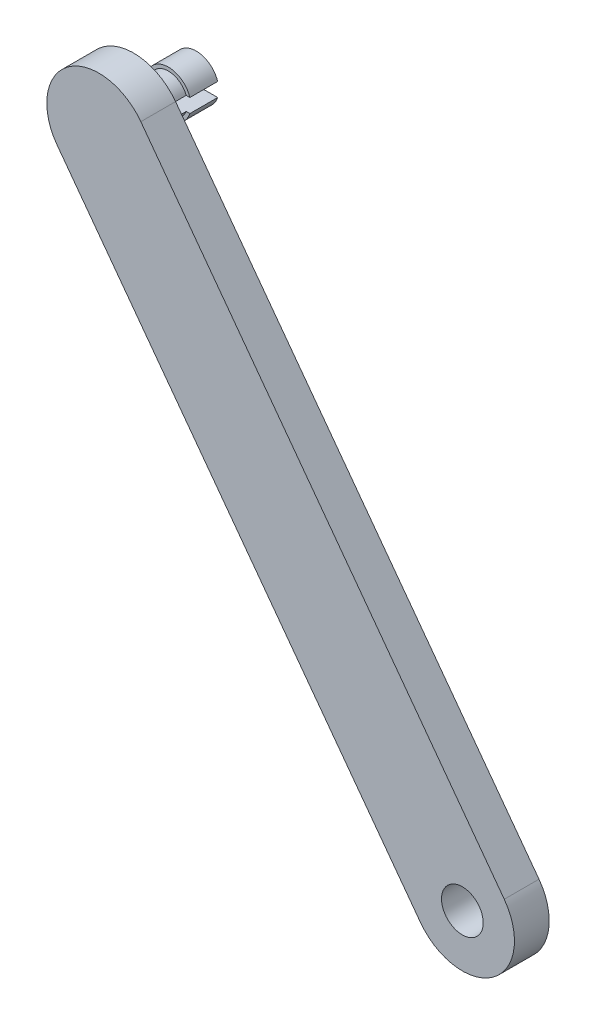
ISO-10303-21;
HEADER;
FILE_DESCRIPTION(('STEP AP214'),'2;1');
FILE_NAME('part.step','',(''),(''),'','','');
FILE_SCHEMA(('AUTOMOTIVE_DESIGN { 1 0 10303 214 1 1 1 1 }'));
ENDSEC;
DATA;
#1=APPLICATION_CONTEXT('core data for automotive mechanical design processes');
#2=APPLICATION_PROTOCOL_DEFINITION('international standard','automotive_design',2000,#1);
#3=PRODUCT_CONTEXT('',#1,'mechanical');
#4=PRODUCT('Part','Part','',(#3));
#5=PRODUCT_RELATED_PRODUCT_CATEGORY('part','',(#4));
#6=PRODUCT_DEFINITION_FORMATION('','',#4);
#7=PRODUCT_DEFINITION_CONTEXT('part definition',#1,'design');
#8=PRODUCT_DEFINITION('design','',#6,#7);
#9=PRODUCT_DEFINITION_SHAPE('','',#8);
#10=(LENGTH_UNIT() NAMED_UNIT(*) SI_UNIT(.MILLI.,.METRE.));
#11=(NAMED_UNIT(*) PLANE_ANGLE_UNIT() SI_UNIT($,.RADIAN.));
#12=(NAMED_UNIT(*) SI_UNIT($,.STERADIAN.) SOLID_ANGLE_UNIT());
#13=UNCERTAINTY_MEASURE_WITH_UNIT(LENGTH_MEASURE(1.E-05),#10,'distance_accuracy_value','');
#14=(GEOMETRIC_REPRESENTATION_CONTEXT(3) GLOBAL_UNCERTAINTY_ASSIGNED_CONTEXT((#13)) GLOBAL_UNIT_ASSIGNED_CONTEXT((#10,
#11,#12)) REPRESENTATION_CONTEXT('',''));
#15=CARTESIAN_POINT('',(0.,0.,0.));
#16=DIRECTION('',(0.,0.,1.));
#17=DIRECTION('',(1.,0.,0.));
#18=AXIS2_PLACEMENT_3D('',#15,#16,#17);
#19=CARTESIAN_POINT('',(-52.308512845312,50.7659486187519,-5.));
#20=DIRECTION('',(0.,0.,1.));
#21=DIRECTION('',(1.,0.,0.));
#22=AXIS2_PLACEMENT_3D('',#19,#20,#21);
#23=CYLINDRICAL_SURFACE('',#22,2.75000000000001);
#24=CARTESIAN_POINT('',(-52.308512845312,50.7659486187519,-5.));
#25=DIRECTION('',(0.,0.,-1.));
#26=DIRECTION('',(-1.,0.,0.));
#27=AXIS2_PLACEMENT_3D('',#24,#25,#26);
#28=CIRCLE('',#27,2.75000000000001);
#29=CARTESIAN_POINT('',(-54.8702505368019,51.7659486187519,-5.));
#30=VERTEX_POINT('',#29);
#31=CARTESIAN_POINT('',(-49.7467751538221,51.7659486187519,-5.));
#32=VERTEX_POINT('',#31);
#33=EDGE_CURVE('E166',#30,#32,#28,.T.);
#34=ORIENTED_EDGE('',*,*,#33,.F.);
#35=DIRECTION('',(0.,0.,1.));
#36=VECTOR('',#35,1.);
#37=CARTESIAN_POINT('',(-54.8702505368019,51.7659486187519,-5.));
#38=LINE('',#37,#36);
#39=CARTESIAN_POINT('',(-54.8702505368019,51.7659486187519,0.));
#40=VERTEX_POINT('',#39);
#41=EDGE_CURVE('E163',#30,#40,#38,.T.);
#42=ORIENTED_EDGE('',*,*,#41,.T.);
#43=CARTESIAN_POINT('',(-52.308512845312,50.7659486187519,0.));
#44=DIRECTION('',(0.,0.,1.));
#45=DIRECTION('',(1.,0.,0.));
#46=AXIS2_PLACEMENT_3D('',#43,#44,#45);
#47=CIRCLE('',#46,2.75000000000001);
#48=CARTESIAN_POINT('',(-49.7467751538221,51.7659486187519,0.));
#49=VERTEX_POINT('',#48);
#50=EDGE_CURVE('E198',#40,#49,#47,.F.);
#51=ORIENTED_EDGE('',*,*,#50,.T.);
#52=DIRECTION('',(0.,0.,1.));
#53=VECTOR('',#52,1.);
#54=CARTESIAN_POINT('',(-49.7467751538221,51.7659486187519,-5.));
#55=LINE('',#54,#53);
#56=EDGE_CURVE('E220',#49,#32,#55,.F.);
#57=ORIENTED_EDGE('',*,*,#56,.T.);
#58=EDGE_LOOP('',(#34,#42,#51,#57));
#59=FACE_BOUND('',#58,.T.);
#60=ADVANCED_FACE('F37',(#59),#23,.T.);
#61=CARTESIAN_POINT('',(-52.308512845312,50.7659486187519,-9.));
#62=DIRECTION('',(0.,0.,1.));
#63=DIRECTION('',(1.,0.,0.));
#64=AXIS2_PLACEMENT_3D('',#61,#62,#63);
#65=CYLINDRICAL_SURFACE('',#64,3.25000000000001);
#66=CARTESIAN_POINT('',(-52.308512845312,50.7659486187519,-9.));
#67=DIRECTION('',(0.,0.,-1.));
#68=DIRECTION('',(-1.,0.,0.));
#69=AXIS2_PLACEMENT_3D('',#66,#67,#68);
#70=CIRCLE('',#69,3.25000000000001);
#71=CARTESIAN_POINT('',(-55.4008420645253,51.7659486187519,-9.));
#72=VERTEX_POINT('',#71);
#73=CARTESIAN_POINT('',(-49.2161836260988,51.7659486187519,-9.));
#74=VERTEX_POINT('',#73);
#75=EDGE_CURVE('E154',#72,#74,#70,.T.);
#76=ORIENTED_EDGE('',*,*,#75,.F.);
#77=DIRECTION('',(0.,0.,1.));
#78=VECTOR('',#77,1.);
#79=CARTESIAN_POINT('',(-55.4008420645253,51.7659486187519,-9.));
#80=LINE('',#79,#78);
#81=CARTESIAN_POINT('',(-55.4008420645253,51.7659486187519,-5.));
#82=VERTEX_POINT('',#81);
#83=EDGE_CURVE('E218',#72,#82,#80,.T.);
#84=ORIENTED_EDGE('',*,*,#83,.T.);
#85=CARTESIAN_POINT('',(-52.308512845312,50.7659486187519,-5.));
#86=DIRECTION('',(0.,0.,-1.));
#87=DIRECTION('',(-1.,0.,0.));
#88=AXIS2_PLACEMENT_3D('',#85,#86,#87);
#89=CIRCLE('',#88,3.25000000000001);
#90=CARTESIAN_POINT('',(-49.2161836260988,51.7659486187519,-5.));
#91=VERTEX_POINT('',#90);
#92=EDGE_CURVE('E155',#82,#91,#89,.T.);
#93=ORIENTED_EDGE('',*,*,#92,.T.);
#94=DIRECTION('',(0.,0.,1.));
#95=VECTOR('',#94,1.);
#96=CARTESIAN_POINT('',(-49.2161836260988,51.7659486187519,-9.));
#97=LINE('',#96,#95);
#98=EDGE_CURVE('E217',#91,#74,#97,.F.);
#99=ORIENTED_EDGE('',*,*,#98,.T.);
#100=EDGE_LOOP('',(#76,#84,#93,#99));
#101=FACE_BOUND('',#100,.T.);
#102=ADVANCED_FACE('F216',(#101),#65,.T.);
#103=CARTESIAN_POINT('',(-52.308512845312,50.7659486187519,-9.));
#104=DIRECTION('',(0.,0.,-1.));
#105=DIRECTION('',(-1.,0.,0.));
#106=AXIS2_PLACEMENT_3D('',#103,#104,#105);
#107=PLANE('',#106);
#108=DIRECTION('',(1.,0.,0.));
#109=VECTOR('',#108,1.);
#110=CARTESIAN_POINT('',(-47.308512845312,51.7659486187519,-9.));
#111=LINE('',#110,#109);
#112=EDGE_CURVE('E151',#72,#74,#111,.T.);
#113=ORIENTED_EDGE('',*,*,#112,.F.);
#114=ORIENTED_EDGE('',*,*,#75,.T.);
#115=EDGE_LOOP('',(#113,#114));
#116=FACE_BOUND('',#115,.T.);
#117=ADVANCED_FACE('F252',(#116),#107,.T.);
#118=CARTESIAN_POINT('',(-52.308512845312,50.7659486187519,-5.));
#119=DIRECTION('',(0.,0.,-1.));
#120=DIRECTION('',(-1.,0.,0.));
#121=AXIS2_PLACEMENT_3D('',#118,#119,#120);
#122=PLANE('',#121);
#123=ORIENTED_EDGE('',*,*,#92,.F.);
#124=DIRECTION('',(1.,0.,0.));
#125=VECTOR('',#124,1.);
#126=CARTESIAN_POINT('',(-52.308512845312,51.7659486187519,-5.));
#127=LINE('',#126,#125);
#128=EDGE_CURVE('E11',#82,#30,#127,.T.);
#129=ORIENTED_EDGE('',*,*,#128,.T.);
#130=ORIENTED_EDGE('',*,*,#33,.T.);
#131=EDGE_CURVE('E41',#32,#91,#127,.T.);
#132=ORIENTED_EDGE('',*,*,#131,.T.);
#133=EDGE_LOOP('',(#123,#129,#130,#132));
#134=FACE_BOUND('',#133,.T.);
#135=ADVANCED_FACE('F208',(#134),#122,.F.);
#136=CARTESIAN_POINT('',(0.,-20.,5.));
#137=DIRECTION('',(0.,0.,-1.));
#138=DIRECTION('',(-1.,0.,0.));
#139=AXIS2_PLACEMENT_3D('',#136,#137,#138);
#140=CYLINDRICAL_SURFACE('',#139,7.49999999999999);
#141=CARTESIAN_POINT('',(0.,-20.,0.));
#142=DIRECTION('',(0.,0.,1.));
#143=DIRECTION('',(1.,0.,0.));
#144=AXIS2_PLACEMENT_3D('',#141,#142,#143);
#145=CIRCLE('',#144,7.49999999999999);
#146=CARTESIAN_POINT('',(-6.03118880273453,-24.4581118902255,0.));
#147=VERTEX_POINT('',#146);
#148=CARTESIAN_POINT('',(6.03118880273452,-15.5418881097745,0.));
#149=VERTEX_POINT('',#148);
#150=EDGE_CURVE('E173',#147,#149,#145,.T.);
#151=ORIENTED_EDGE('',*,*,#150,.T.);
#152=DIRECTION('',(0.,0.,-1.));
#153=VECTOR('',#152,1.);
#154=CARTESIAN_POINT('',(6.03118880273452,-15.5418881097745,5.));
#155=LINE('',#154,#153);
#156=CARTESIAN_POINT('',(6.03118880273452,-15.5418881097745,5.));
#157=VERTEX_POINT('',#156);
#158=EDGE_CURVE('E196',#157,#149,#155,.T.);
#159=ORIENTED_EDGE('',*,*,#158,.F.);
#160=CARTESIAN_POINT('',(0.,-20.,5.));
#161=DIRECTION('',(0.,0.,1.));
#162=DIRECTION('',(1.,0.,0.));
#163=AXIS2_PLACEMENT_3D('',#160,#161,#162);
#164=CIRCLE('',#163,7.49999999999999);
#165=CARTESIAN_POINT('',(-6.03118880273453,-24.4581118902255,5.));
#166=VERTEX_POINT('',#165);
#167=EDGE_CURVE('E176',#166,#157,#164,.T.);
#168=ORIENTED_EDGE('',*,*,#167,.F.);
#169=DIRECTION('',(0.,0.,-1.));
#170=VECTOR('',#169,1.);
#171=CARTESIAN_POINT('',(-6.03118880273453,-24.4581118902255,5.));
#172=LINE('',#171,#170);
#173=EDGE_CURVE('E182',#166,#147,#172,.T.);
#174=ORIENTED_EDGE('',*,*,#173,.T.);
#175=EDGE_LOOP('',(#151,#159,#168,#174));
#176=FACE_BOUND('',#175,.T.);
#177=ADVANCED_FACE('F39',(#176),#140,.T.);
#178=CARTESIAN_POINT('',(6.03118880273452,-15.5418881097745,5.));
#179=DIRECTION('',(-0.804158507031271,-0.594414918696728,0.));
#180=DIRECTION('',(0.594414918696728,-0.804158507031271,0.));
#181=AXIS2_PLACEMENT_3D('',#178,#179,#180);
#182=PLANE('',#181);
#183=DIRECTION('',(-0.594414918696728,0.804158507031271,0.));
#184=VECTOR('',#183,1.);
#185=CARTESIAN_POINT('',(6.03118880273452,-15.5418881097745,0.));
#186=LINE('',#185,#184);
#187=CARTESIAN_POINT('',(-46.2773240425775,55.2240605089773,0.));
#188=VERTEX_POINT('',#187);
#189=EDGE_CURVE('E185',#149,#188,#186,.T.);
#190=ORIENTED_EDGE('',*,*,#189,.T.);
#191=DIRECTION('',(0.,0.,-1.));
#192=VECTOR('',#191,1.);
#193=CARTESIAN_POINT('',(-46.2773240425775,55.2240605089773,5.));
#194=LINE('',#193,#192);
#195=CARTESIAN_POINT('',(-46.2773240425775,55.2240605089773,5.));
#196=VERTEX_POINT('',#195);
#197=EDGE_CURVE('E193',#196,#188,#194,.T.);
#198=ORIENTED_EDGE('',*,*,#197,.F.);
#199=DIRECTION('',(-0.594414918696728,0.804158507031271,0.));
#200=VECTOR('',#199,1.);
#201=CARTESIAN_POINT('',(6.03118880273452,-15.5418881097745,5.));
#202=LINE('',#201,#200);
#203=EDGE_CURVE('E90',#157,#196,#202,.T.);
#204=ORIENTED_EDGE('',*,*,#203,.F.);
#205=ORIENTED_EDGE('',*,*,#158,.T.);
#206=EDGE_LOOP('',(#190,#198,#204,#205));
#207=FACE_BOUND('',#206,.T.);
#208=ADVANCED_FACE('F286',(#207),#182,.F.);
#209=CARTESIAN_POINT('',(-52.308512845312,50.7659486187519,5.));
#210=DIRECTION('',(0.,0.,-1.));
#211=DIRECTION('',(-1.,0.,0.));
#212=AXIS2_PLACEMENT_3D('',#209,#210,#211);
#213=CYLINDRICAL_SURFACE('',#212,7.50000000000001);
#214=CARTESIAN_POINT('',(-52.308512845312,50.7659486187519,0.));
#215=DIRECTION('',(0.,0.,1.));
#216=DIRECTION('',(1.,0.,0.));
#217=AXIS2_PLACEMENT_3D('',#214,#215,#216);
#218=CIRCLE('',#217,7.50000000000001);
#219=CARTESIAN_POINT('',(-58.3397016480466,46.3078367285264,0.));
#220=VERTEX_POINT('',#219);
#221=EDGE_CURVE('E187',#188,#220,#218,.T.);
#222=ORIENTED_EDGE('',*,*,#221,.T.);
#223=DIRECTION('',(0.,0.,-1.));
#224=VECTOR('',#223,1.);
#225=CARTESIAN_POINT('',(-58.3397016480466,46.3078367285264,5.));
#226=LINE('',#225,#224);
#227=CARTESIAN_POINT('',(-58.3397016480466,46.3078367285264,5.));
#228=VERTEX_POINT('',#227);
#229=EDGE_CURVE('E191',#228,#220,#226,.T.);
#230=ORIENTED_EDGE('',*,*,#229,.F.);
#231=CARTESIAN_POINT('',(-52.308512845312,50.7659486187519,5.));
#232=DIRECTION('',(0.,0.,1.));
#233=DIRECTION('',(1.,0.,0.));
#234=AXIS2_PLACEMENT_3D('',#231,#232,#233);
#235=CIRCLE('',#234,7.50000000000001);
#236=EDGE_CURVE('E179',#196,#228,#235,.T.);
#237=ORIENTED_EDGE('',*,*,#236,.F.);
#238=ORIENTED_EDGE('',*,*,#197,.T.);
#239=EDGE_LOOP('',(#222,#230,#237,#238));
#240=FACE_BOUND('',#239,.T.);
#241=ADVANCED_FACE('F284',(#240),#213,.T.);
#242=CARTESIAN_POINT('',(-6.03118880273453,-24.4581118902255,5.));
#243=DIRECTION('',(0.804158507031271,0.594414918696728,0.));
#244=DIRECTION('',(-0.594414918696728,0.804158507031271,0.));
#245=AXIS2_PLACEMENT_3D('',#242,#243,#244);
#246=PLANE('',#245);
#247=DIRECTION('',(0.594414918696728,-0.804158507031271,0.));
#248=VECTOR('',#247,1.);
#249=CARTESIAN_POINT('',(-6.03118880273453,-24.4581118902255,0.));
#250=LINE('',#249,#248);
#251=EDGE_CURVE('E82',#220,#147,#250,.T.);
#252=ORIENTED_EDGE('',*,*,#251,.T.);
#253=ORIENTED_EDGE('',*,*,#173,.F.);
#254=DIRECTION('',(0.594414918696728,-0.804158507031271,0.));
#255=VECTOR('',#254,1.);
#256=CARTESIAN_POINT('',(-6.03118880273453,-24.4581118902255,5.));
#257=LINE('',#256,#255);
#258=EDGE_CURVE('E61',#228,#166,#257,.T.);
#259=ORIENTED_EDGE('',*,*,#258,.F.);
#260=ORIENTED_EDGE('',*,*,#229,.T.);
#261=EDGE_LOOP('',(#252,#253,#259,#260));
#262=FACE_BOUND('',#261,.T.);
#263=ADVANCED_FACE('F279',(#262),#246,.F.);
#264=CARTESIAN_POINT('',(0.,-20.,5.));
#265=DIRECTION('',(0.,0.,1.));
#266=DIRECTION('',(1.,0.,0.));
#267=AXIS2_PLACEMENT_3D('',#264,#265,#266);
#268=PLANE('',#267);
#269=CARTESIAN_POINT('',(0.,-20.,5.));
#270=DIRECTION('',(0.,0.,1.));
#271=DIRECTION('',(1.,0.,0.));
#272=AXIS2_PLACEMENT_3D('',#269,#270,#271);
#273=CIRCLE('',#272,3.);
#274=CARTESIAN_POINT('',(3.,-20.,5.));
#275=VERTEX_POINT('',#274);
#276=EDGE_CURVE('E169',#275,#275,#273,.T.);
#277=ORIENTED_EDGE('',*,*,#276,.F.);
#278=EDGE_LOOP('',(#277));
#279=FACE_BOUND('',#278,.T.);
#280=ORIENTED_EDGE('',*,*,#167,.T.);
#281=ORIENTED_EDGE('',*,*,#203,.T.);
#282=ORIENTED_EDGE('',*,*,#236,.T.);
#283=ORIENTED_EDGE('',*,*,#258,.T.);
#284=EDGE_LOOP('',(#280,#281,#282,#283));
#285=FACE_BOUND('',#284,.T.);
#286=ADVANCED_FACE('F272',(#279,#285),#268,.T.);
#287=CARTESIAN_POINT('',(0.,-20.,0.));
#288=DIRECTION('',(0.,0.,1.));
#289=DIRECTION('',(1.,0.,0.));
#290=AXIS2_PLACEMENT_3D('',#287,#288,#289);
#291=PLANE('',#290);
#292=DIRECTION('',(1.,0.,0.));
#293=VECTOR('',#292,1.);
#294=CARTESIAN_POINT('',(-47.308512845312,51.7659486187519,0.));
#295=LINE('',#294,#293);
#296=EDGE_CURVE('E230',#40,#49,#295,.T.);
#297=ORIENTED_EDGE('',*,*,#296,.T.);
#298=ORIENTED_EDGE('',*,*,#50,.F.);
#299=EDGE_LOOP('',(#297,#298));
#300=FACE_BOUND('',#299,.T.);
#301=DIRECTION('',(-1.,0.,0.));
#302=VECTOR('',#301,1.);
#303=CARTESIAN_POINT('',(-47.308512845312,49.7659486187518,0.));
#304=LINE('',#303,#302);
#305=CARTESIAN_POINT('',(-49.7467751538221,49.7659486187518,0.));
#306=VERTEX_POINT('',#305);
#307=CARTESIAN_POINT('',(-54.8702505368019,49.7659486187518,0.));
#308=VERTEX_POINT('',#307);
#309=EDGE_CURVE('E231',#306,#308,#304,.T.);
#310=ORIENTED_EDGE('',*,*,#309,.T.);
#311=EDGE_CURVE('E199',#306,#308,#47,.F.);
#312=ORIENTED_EDGE('',*,*,#311,.F.);
#313=EDGE_LOOP('',(#310,#312));
#314=FACE_BOUND('',#313,.T.);
#315=CARTESIAN_POINT('',(0.,-20.,0.));
#316=DIRECTION('',(0.,0.,1.));
#317=DIRECTION('',(1.,0.,0.));
#318=AXIS2_PLACEMENT_3D('',#315,#316,#317);
#319=CIRCLE('',#318,3.);
#320=CARTESIAN_POINT('',(3.,-20.,0.));
#321=VERTEX_POINT('',#320);
#322=EDGE_CURVE('E170',#321,#321,#319,.T.);
#323=ORIENTED_EDGE('',*,*,#322,.T.);
#324=EDGE_LOOP('',(#323));
#325=FACE_BOUND('',#324,.T.);
#326=ORIENTED_EDGE('',*,*,#150,.F.);
#327=ORIENTED_EDGE('',*,*,#251,.F.);
#328=ORIENTED_EDGE('',*,*,#221,.F.);
#329=ORIENTED_EDGE('',*,*,#189,.F.);
#330=EDGE_LOOP('',(#326,#327,#328,#329));
#331=FACE_BOUND('',#330,.T.);
#332=ADVANCED_FACE('F238',(#300,#314,#325,#331),#291,.F.);
#333=CARTESIAN_POINT('',(0.,-20.,0.));
#334=DIRECTION('',(0.,0.,1.));
#335=DIRECTION('',(1.,0.,0.));
#336=AXIS2_PLACEMENT_3D('',#333,#334,#335);
#337=CYLINDRICAL_SURFACE('',#336,3.);
#338=ORIENTED_EDGE('',*,*,#322,.F.);
#339=EDGE_LOOP('',(#338));
#340=FACE_BOUND('',#339,.T.);
#341=ORIENTED_EDGE('',*,*,#276,.T.);
#342=EDGE_LOOP('',(#341));
#343=FACE_BOUND('',#342,.T.);
#344=ADVANCED_FACE('F263',(#340,#343),#337,.F.);
#345=CARTESIAN_POINT('',(-49.7467751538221,49.7659486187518,-5.));
#346=VERTEX_POINT('',#345);
#347=CARTESIAN_POINT('',(-54.8702505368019,49.7659486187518,-5.));
#348=VERTEX_POINT('',#347);
#349=EDGE_CURVE('E158',#346,#348,#28,.T.);
#350=ORIENTED_EDGE('',*,*,#349,.F.);
#351=DIRECTION('',(0.,0.,1.));
#352=VECTOR('',#351,1.);
#353=CARTESIAN_POINT('',(-49.7467751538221,49.7659486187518,-5.));
#354=LINE('',#353,#352);
#355=EDGE_CURVE('E144',#346,#306,#354,.T.);
#356=ORIENTED_EDGE('',*,*,#355,.T.);
#357=ORIENTED_EDGE('',*,*,#311,.T.);
#358=DIRECTION('',(0.,0.,1.));
#359=VECTOR('',#358,1.);
#360=CARTESIAN_POINT('',(-54.8702505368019,49.7659486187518,-5.));
#361=LINE('',#360,#359);
#362=EDGE_CURVE('E145',#308,#348,#361,.F.);
#363=ORIENTED_EDGE('',*,*,#362,.T.);
#364=EDGE_LOOP('',(#350,#356,#357,#363));
#365=FACE_BOUND('',#364,.T.);
#366=ADVANCED_FACE('F241',(#365),#23,.T.);
#367=CARTESIAN_POINT('',(-49.2161836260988,49.7659486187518,-9.));
#368=VERTEX_POINT('',#367);
#369=CARTESIAN_POINT('',(-55.4008420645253,49.7659486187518,-9.));
#370=VERTEX_POINT('',#369);
#371=EDGE_CURVE('E150',#368,#370,#70,.T.);
#372=ORIENTED_EDGE('',*,*,#371,.F.);
#373=DIRECTION('',(0.,0.,1.));
#374=VECTOR('',#373,1.);
#375=CARTESIAN_POINT('',(-49.2161836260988,49.7659486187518,-9.));
#376=LINE('',#375,#374);
#377=CARTESIAN_POINT('',(-49.2161836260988,49.7659486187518,-5.));
#378=VERTEX_POINT('',#377);
#379=EDGE_CURVE('E134',#368,#378,#376,.T.);
#380=ORIENTED_EDGE('',*,*,#379,.T.);
#381=CARTESIAN_POINT('',(-55.4008420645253,49.7659486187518,-5.));
#382=VERTEX_POINT('',#381);
#383=EDGE_CURVE('E160',#378,#382,#89,.T.);
#384=ORIENTED_EDGE('',*,*,#383,.T.);
#385=DIRECTION('',(0.,0.,1.));
#386=VECTOR('',#385,1.);
#387=CARTESIAN_POINT('',(-55.4008420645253,49.7659486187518,-9.));
#388=LINE('',#387,#386);
#389=EDGE_CURVE('E52',#382,#370,#388,.F.);
#390=ORIENTED_EDGE('',*,*,#389,.T.);
#391=EDGE_LOOP('',(#372,#380,#384,#390));
#392=FACE_BOUND('',#391,.T.);
#393=ADVANCED_FACE('F153',(#392),#65,.T.);
#394=DIRECTION('',(-1.,0.,0.));
#395=VECTOR('',#394,1.);
#396=CARTESIAN_POINT('',(-47.308512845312,49.7659486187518,-9.));
#397=LINE('',#396,#395);
#398=EDGE_CURVE('E137',#368,#370,#397,.T.);
#399=ORIENTED_EDGE('',*,*,#398,.F.);
#400=ORIENTED_EDGE('',*,*,#371,.T.);
#401=EDGE_LOOP('',(#399,#400));
#402=FACE_BOUND('',#401,.T.);
#403=ADVANCED_FACE('F149',(#402),#107,.T.);
#404=ORIENTED_EDGE('',*,*,#383,.F.);
#405=DIRECTION('',(-1.,0.,0.));
#406=VECTOR('',#405,1.);
#407=CARTESIAN_POINT('',(-52.308512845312,49.7659486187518,-5.));
#408=LINE('',#407,#406);
#409=EDGE_CURVE('E139',#378,#346,#408,.T.);
#410=ORIENTED_EDGE('',*,*,#409,.T.);
#411=ORIENTED_EDGE('',*,*,#349,.T.);
#412=EDGE_CURVE('E201',#348,#382,#408,.T.);
#413=ORIENTED_EDGE('',*,*,#412,.T.);
#414=EDGE_LOOP('',(#404,#410,#411,#413));
#415=FACE_BOUND('',#414,.T.);
#416=ADVANCED_FACE('F242',(#415),#122,.F.);
#417=CARTESIAN_POINT('',(-47.308512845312,51.7659486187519,0.));
#418=DIRECTION('',(0.,1.,0.));
#419=DIRECTION('',(0.,0.,1.));
#420=AXIS2_PLACEMENT_3D('',#417,#418,#419);
#421=PLANE('',#420);
#422=ORIENTED_EDGE('',*,*,#128,.F.);
#423=ORIENTED_EDGE('',*,*,#83,.F.);
#424=ORIENTED_EDGE('',*,*,#112,.T.);
#425=ORIENTED_EDGE('',*,*,#98,.F.);
#426=ORIENTED_EDGE('',*,*,#131,.F.);
#427=ORIENTED_EDGE('',*,*,#56,.F.);
#428=ORIENTED_EDGE('',*,*,#296,.F.);
#429=ORIENTED_EDGE('',*,*,#41,.F.);
#430=EDGE_LOOP('',(#422,#423,#424,#425,#426,#427,#428,#429));
#431=FACE_BOUND('',#430,.T.);
#432=ADVANCED_FACE('F244',(#431),#421,.F.);
#433=CARTESIAN_POINT('',(-47.308512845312,49.7659486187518,0.));
#434=DIRECTION('',(0.,-1.,0.));
#435=DIRECTION('',(0.,0.,-1.));
#436=AXIS2_PLACEMENT_3D('',#433,#434,#435);
#437=PLANE('',#436);
#438=ORIENTED_EDGE('',*,*,#409,.F.);
#439=ORIENTED_EDGE('',*,*,#379,.F.);
#440=ORIENTED_EDGE('',*,*,#398,.T.);
#441=ORIENTED_EDGE('',*,*,#389,.F.);
#442=ORIENTED_EDGE('',*,*,#412,.F.);
#443=ORIENTED_EDGE('',*,*,#362,.F.);
#444=ORIENTED_EDGE('',*,*,#309,.F.);
#445=ORIENTED_EDGE('',*,*,#355,.F.);
#446=EDGE_LOOP('',(#438,#439,#440,#441,#442,#443,#444,#445));
#447=FACE_BOUND('',#446,.T.);
#448=ADVANCED_FACE('F136',(#447),#437,.F.);
#449=CLOSED_SHELL('',(#60,#102,#117,#135,#177,#208,#241,#263,#286,#332,#344,#366,#393,#403,#416,
#432,#448));
#450=MANIFOLD_SOLID_BREP('B2',#449);
#451=ADVANCED_BREP_SHAPE_REPRESENTATION('',(#18,#450),#14);
#452=SHAPE_DEFINITION_REPRESENTATION(#9,#451);
ENDSEC;
END-ISO-10303-21;
